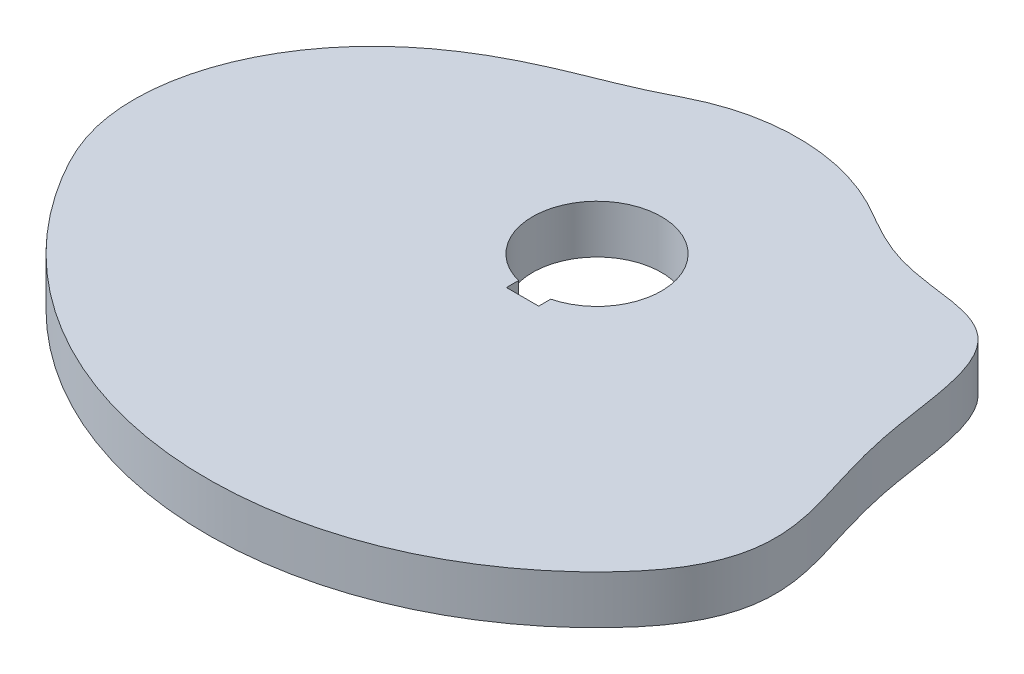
from build123d import *

# Parameters (mm, degrees)
SKETCH1_R                        = 177.8
SKETCH1_R_2                      = 25.4
DISC_CW_INSIDE_SWINGINGARM_DEPTH = 19.05
KEYWAY_0_5000_X_0_3750MM_DEPTH   = 253.167766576
SINGLE_SURFACE_SKETCH_R          = 177.8
SINGLE_SURFACE_DEPTH             = 20.6502


with BuildPart() as part:
    # Sketch1 → Disc_ CW_ Inside_ SwingingArm (new body)
    with BuildSketch(Plane(origin=(0, 0, 0), x_dir=(1, 0, 0), z_dir=(0, 1, 0))):
        with Locations(Location((0, 0, 0), (0, 0, 270))):
            Circle(SKETCH1_R)
        with Locations(Location((0, 0, 0), (0, 0, 270))):
            Circle(SKETCH1_R_2, mode=Mode.SUBTRACT)
    extrude(amount=-DISC_CW_INSIDE_SWINGINGARM_DEPTH)

    # Sketch7 → Keyway_ 0.5000 x 0.3750mm (cut, through all)
    with BuildSketch(Plane(origin=(0, 0, 0), x_dir=(1, 0, 0), z_dir=(0, 1, 0))):
        with BuildLine():
            Line((-6.35, -24.593444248), (-6.35, -29.355944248))
            Line((-6.35, -29.355944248), (6.35, -29.355944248))
            Line((6.35, -29.355944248), (6.35, -24.593444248))
            ThreePointArc((6.35, -24.593444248), (0, 25.4), (-6.35, -24.593444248))
        make_face()
    extrude(amount=-KEYWAY_0_5000_X_0_3750MM_DEPTH, mode=Mode.SUBTRACT)

    # Single Surface Sketch → Single Surface (cut)
    with BuildSketch(Plane(origin=(0, 0, 0), x_dir=(1, 0, 0), z_dir=(0, 1, 0))):
        Circle(SINGLE_SURFACE_SKETCH_R)
        with BuildLine():
            add(Edge.make_bspline(
                [(114.054198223, 24.302791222), (113.900836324, 25.022534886), (113.599117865, 26.37563906), (113.11679871, 28.335120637), (112.620093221, 30.162893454), (112.091035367, 31.920319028), (111.52865963, 33.603254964), (110.932781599, 35.207999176), (110.303920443, 36.73148022), (109.643177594, 38.171445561), (108.9520673, 39.526633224), (108.232302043, 40.796907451), (107.485541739, 41.983338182), (106.713123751, 43.088205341), (105.915798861, 44.11491405), (105.09350463, 45.067816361), (104.245209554, 45.951948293), (103.368857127, 46.772705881), (102.461427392, 47.535497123), (101.519116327, 48.245414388), (100.537613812, 48.90697103), (99.512443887, 49.523936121), (98.439320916, 50.099284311), (97.314474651, 50.635258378), (96.134905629, 51.133524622), (94.898546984, 51.595390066), (93.604325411, 52.022046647), (92.252128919, 52.414810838), (90.842699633, 52.775334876), (89.377475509, 53.105775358), (87.858406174, 53.408914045), (86.287766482, 53.688232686), (84.667988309, 53.947947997), (83.00152781, 54.193014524), (81.290782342, 54.429102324), (79.538068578, 54.662553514), (77.745670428, 54.900317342), (75.915961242, 55.149857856), (74.051598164, 55.419022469), (72.155776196, 55.715855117), (70.232515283, 56.048336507), (68.286936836, 56.424039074), (66.325470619, 56.849698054), (64.355925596, 57.330723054), (62.387366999, 57.870702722), (60.429771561, 58.470979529), (58.493481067, 59.130380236), (56.588528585, 59.845170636), (54.723952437, 60.609260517), (52.907222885, 61.414628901), (51.143880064, 62.25189063), (49.437429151, 63.110901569), (47.789480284, 63.981307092), (46.200076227, 64.852970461), (44.668129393, 65.716257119), (43.191894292, 66.562190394), (41.769409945, 67.382500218), (40.398897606, 68.169649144), (39.079014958, 68.916721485), (37.806636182, 69.619179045), (36.563071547, 70.280549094), (35.328237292, 70.909138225), (34.085336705, 71.514930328), (32.832033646, 72.098901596), (31.568734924, 72.660920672), (30.295818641, 73.200803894), (29.013674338, 73.718390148), (27.722692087, 74.213520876), (26.423265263, 74.686045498), (25.115789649, 75.135820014), (23.800663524, 75.562707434), (22.478287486, 75.966577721), (21.149064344, 76.347307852), (19.813398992, 76.704781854), (18.471698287, 77.038890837), (17.124370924, 77.349533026), (15.771827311, 77.636613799), (14.414479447, 77.900045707), (13.052740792, 78.139748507), (11.687026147, 78.355649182), (10.31775152, 78.547681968), (8.945334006, 78.715788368), (7.570191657, 78.859917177), (6.192743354, 78.980024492), (4.813408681, 79.076073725), (3.432607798, 79.148035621), (2.050761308, 79.195888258), (0.668290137, 79.219617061), (-0.714384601, 79.2192148), (-2.096841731, 79.1946816), (-3.478660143, 79.146024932), (-4.859418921, 79.073259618), (-6.238697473, 78.976407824), (-7.616075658, 78.855499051), (-8.991133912, 78.710570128), (-10.363453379, 78.541665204), (-11.732616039, 78.348835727), (-13.098204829, 78.132140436), (-14.45980378, 77.891645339), (-15.816998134, 77.627423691), (-17.169374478, 77.339555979), (-18.516520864, 77.028129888), (-19.858026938, 76.693240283), (-21.193484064, 76.334989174), (-22.522485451, 75.953485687), (-23.844626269, 75.548846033), (-25.159503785, 75.12119347), (-26.466717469, 74.670658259), (-27.765869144, 74.19737766), (-29.056563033, 73.701495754), (-30.338406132, 73.183163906), (-31.61100741, 72.642538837), (-32.831883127, 72.098547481), (-34.103423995, 71.506506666), (-35.412060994, 70.868626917), (-36.831435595, 70.15730777), (-38.292360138, 69.416331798), (-39.834890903, 68.634709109), (-41.455290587, 67.823304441), (-43.14752035, 66.993186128), (-44.903620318, 66.154522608), (-46.714357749, 65.315880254), (-48.569695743, 64.482871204), (-50.460956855, 63.660407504), (-52.380714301, 62.845340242), (-54.326950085, 62.03648373), (-56.29969533, 61.22912717), (-58.299512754, 60.418917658), (-60.326898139, 59.601270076), (-62.382293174, 58.771607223), (-64.465995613, 57.925339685), (-66.578108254, 57.057908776), (-68.718489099, 56.164806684), (-70.886713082, 55.241599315), (-73.082042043, 54.283946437), (-75.303403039, 53.287621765), (-77.549374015, 52.24853302), (-79.818176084, 51.162742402), (-82.107671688, 50.026487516), (-84.41536794, 48.836202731), (-86.738424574, 47.588540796), (-89.073665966, 46.280394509), (-91.417596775, 44.908918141), (-93.766420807, 43.471548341), (-96.116062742, 41.966024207), (-98.462192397, 40.390406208), (-100.800251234, 38.743093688), (-103.12548081, 37.022840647), (-105.432952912, 35.228769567), (-107.717601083, 33.360383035), (-109.97425328, 31.417572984), (-112.197665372, 29.400627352), (-114.382555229, 27.310234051), (-116.523637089, 25.147482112), (-118.615655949, 22.91385995), (-120.653421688, 20.611250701), (-122.631842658, 18.241924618), (-124.545958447, 15.808528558), (-126.390971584, 13.314072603), (-128.1622779, 10.761913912), (-129.855495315, 8.15573789), (-131.466490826, 5.499536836), (-132.991405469, 2.797586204), (-134.426677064, 0.054418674), (-135.769060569, -2.72520379), (-137.015645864, -5.536319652), (-138.163872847, -8.3737991), (-139.211543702, -11.232376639), (-140.156832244, -14.106684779), (-140.998290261, -16.991288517), (-141.734850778, -19.880720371), (-142.365828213, -22.769515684), (-142.890915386, -25.652247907), (-143.310177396, -28.523563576), (-143.62404233, -31.378216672), (-143.833289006, -34.211102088), (-143.939031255, -37.017287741), (-143.942700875, -39.792045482), (-143.846021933, -42.530878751), (-143.651003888, -45.229552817), (-143.359853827, -47.884104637), (-142.975173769, -50.490914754), (-142.499074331, -53.046705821), (-141.935984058, -55.549865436), (-141.284866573, -58.000597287), (-140.549287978, -60.403325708), (-139.73016426, -62.764720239), (-138.828934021, -65.092649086), (-137.846827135, -67.395741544), (-136.785205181, -69.683082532), (-135.645669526, -71.963847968), (-134.430380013, -74.247062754), (-133.142964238, -76.539171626), (-131.796369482, -78.834364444), (-130.40176322, -81.120773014), (-128.966109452, -83.384218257), (-127.491222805, -85.622293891), (-125.977487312, -87.834280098), (-124.425381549, -90.019513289), (-122.83537362, -92.177325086), (-121.207949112, -94.307058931), (-119.543603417, -96.408065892), (-117.842843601, -98.479706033), (-116.106187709, -100.521348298), (-114.334164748, -102.532370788), (-112.527314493, -104.512160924), (-110.686187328, -106.460115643), (-108.811344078, -108.37564158), (-106.903355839, -110.258155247), (-104.962803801, -112.107083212), (-102.990279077, -113.921862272), (-100.986382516, -115.701939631), (-98.951724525, -117.446773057), (-96.88692488, -119.155831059), (-94.792612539, -120.82859304), (-92.66942545, -122.464549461), (-90.518010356, -124.063201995), (-88.3390226, -125.624063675), (-86.133125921, -127.146659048), (-83.900992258, -128.630524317), (-81.64330154, -130.075207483), (-79.360741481, -131.48026848), (-77.054007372, -132.845279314), (-74.723801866, -134.169824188), (-72.370834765, -135.453499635), (-69.995822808, -136.695914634), (-67.599489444, -137.896690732), (-65.182564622, -139.055462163), (-62.745784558, -140.171875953), (-60.289891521, -141.245592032), (-57.815633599, -142.276283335), (-55.323764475, -143.263635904), (-52.815043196, -144.207348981), (-50.290233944, -145.107135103), (-47.750105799, -145.962720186), (-45.195432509, -146.773843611), (-42.626992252, -147.540258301), (-40.045567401, -148.261730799), (-37.451944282, -148.938041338), (-34.846912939, -149.568983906), (-32.231266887, -150.154366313), (-29.60580288, -150.694010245), (-26.971320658, -151.187751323), (-24.328622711, -151.635439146), (-21.67851403, -152.036937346), (-19.021801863, -152.392123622), (-16.359295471, -152.70088978), (-13.69180588, -152.963141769), (-11.020145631, -153.178799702), (-8.34512854, -153.34779789), (-5.667569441, -153.470084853), (-2.988283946, -153.545623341), (-0.308088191, -153.574390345), (2.372201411, -153.556377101), (5.051768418, -153.491589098), (7.729796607, -153.38004607), (10.405470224, -153.221781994), (13.077974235, -153.016845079), (15.746494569, -152.765297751), (18.410218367, -152.467216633), (21.068334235, -152.122692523), (23.720032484, -151.731830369), (26.364505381, -151.294749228), (29.000947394, -150.811582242), (31.628555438, -150.282476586), (34.246529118, -149.707593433), (36.854070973, -149.087107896), (39.450386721, -148.421208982), (42.034685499, -147.710099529), (44.606180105, -146.95399615), (47.164087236, -146.15312916), (49.707627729, -145.307742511), (52.236026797, -144.418093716), (54.748514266, -143.48445377), (57.244324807, -142.50710707), (59.722698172, -141.486351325), (62.182879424, -140.422497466), (64.624119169, -139.315869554), (67.045673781, -138.166804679), (69.446805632, -136.975652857), (71.826783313, -135.742776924), (74.184881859, -134.468552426), (76.520382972, -133.153367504), (78.832575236, -131.797622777), (81.120754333, -130.401731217), (83.384223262, -128.966118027), (85.62229255, -127.491220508), (87.834280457, -125.977487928), (90.019513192, -124.425381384), (92.177325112, -122.835373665), (94.307058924, -121.207949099), (96.408065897, -119.543603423), (98.47970602, -117.84284359), (100.521348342, -116.106187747), (102.532370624, -114.334164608), (104.512161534, -112.527315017), (106.460113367, -110.686185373), (108.375650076, -108.811351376), (110.255065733, -106.906427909), (112.090514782, -104.980470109), (113.870058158, -103.0399956), (115.584293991, -101.089442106), (117.228285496, -99.129471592), (118.797451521, -97.161058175), (120.28763046, -95.185526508), (121.695141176, -93.204483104), (123.016847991, -91.219743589), (124.250211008, -89.233244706), (125.393322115, -87.246947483), (126.44492244, -85.262734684), (127.404399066, -83.282307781), (128.271759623, -81.307089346), (129.047585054, -79.338137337), (129.732962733, -77.376077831), (130.32940416, -75.421062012), (130.838753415, -73.472751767), (131.263093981, -71.530335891), (131.604662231, -69.592576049), (131.86577551, -67.657878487), (132.048781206, -65.72438467), (132.156030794, -63.790071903), (132.189879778, -61.852854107), (132.152711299, -59.910673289), (132.046978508, -57.961573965), (131.875258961, -56.003755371), (131.640313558, -54.035599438), (131.345142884, -52.055675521), (130.993035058, -50.062725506), (130.587600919, -48.055634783), (130.132794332, -46.033395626), (129.632917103, -43.995069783), (129.092609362, -41.939756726), (128.516826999, -39.866573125), (127.910807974, -37.774647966), (127.280028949, -35.663136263), (126.630152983, -33.531252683), (125.966968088, -31.378324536), (125.296315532, -29.203861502), (124.624006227, -27.007637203), (123.955723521, -24.789775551), (123.296911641, -22.550832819), (122.652650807, -20.291865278), (122.027522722, -18.014472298), (121.425473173, -15.720806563), (120.849681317, -13.413546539), (120.302446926, -11.095831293), (119.785106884, -8.771163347), (119.297990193, -6.443290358), (118.840416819, -4.116079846), (118.410740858, -1.793402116), (118.006433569, 0.520965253), (117.62419802, 2.823401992), (117.260104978, 5.110474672), (116.909739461, 7.37893233), (116.568348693, 9.625673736), (116.230984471, 11.847694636), (115.892635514, 14.042024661), (115.54834753, 16.205662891), (115.193330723, 18.335521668), (114.823054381, 20.428380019), (114.445971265, 22.414306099), (114.182577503, 23.700293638), (114.054198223, 24.302791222)],
                knots=[0, 0, 0, 0, 0.002758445, 0.005196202, 0.007563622, 0.00985746, 0.012074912, 0.014213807, 0.016272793, 0.018251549, 0.020150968, 0.021973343, 0.023722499, 0.025403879, 0.027024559, 0.028593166, 0.030119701, 0.031615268, 0.033091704, 0.034561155, 0.036035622, 0.037526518, 0.039044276, 0.040598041, 0.042195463, 0.0438426, 0.045543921, 0.047302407, 0.049119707, 0.050996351, 0.052931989, 0.054925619, 0.056975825, 0.059080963, 0.061239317, 0.06344919, 0.065708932, 0.068016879, 0.070371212, 0.072769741, 0.075209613, 0.077687, 0.080196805, 0.082732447, 0.085285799, 0.087847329, 0.090406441, 0.09295199, 0.095472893, 0.097958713, 0.100400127, 0.102789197, 0.105119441, 0.107385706, 0.109583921, 0.111710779, 0.113763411, 0.115739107, 0.117635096, 0.119448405, 0.121186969, 0.122914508, 0.124642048, 0.126369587, 0.128097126, 0.129824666, 0.131552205, 0.133279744, 0.135007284, 0.136734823, 0.138462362, 0.140189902, 0.141917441, 0.14364498, 0.14537252, 0.147100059, 0.148827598, 0.150555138, 0.152282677, 0.154010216, 0.155737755, 0.157465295, 0.159192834, 0.160920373, 0.162647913, 0.164375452, 0.166102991, 0.167830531, 0.16955807, 0.171285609, 0.173013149, 0.174740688, 0.176468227, 0.178195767, 0.179923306, 0.181650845, 0.183378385, 0.185105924, 0.186833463, 0.188561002, 0.190288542, 0.192016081, 0.19374362, 0.19547116, 0.197198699, 0.198926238, 0.200653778, 0.202381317, 0.204108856, 0.205836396, 0.207563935, 0.209291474, 0.211019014, 0.212573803, 0.214548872, 0.216475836, 0.218524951, 0.220689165, 0.222957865, 0.225317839, 0.227754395, 0.230252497, 0.232797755, 0.235377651, 0.237982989, 0.240615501, 0.243277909, 0.245973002, 0.248703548, 0.251472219, 0.254281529, 0.257133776, 0.260031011, 0.262975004, 0.265967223, 0.269008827, 0.272100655, 0.275243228, 0.278436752, 0.281681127, 0.284975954, 0.288320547, 0.291713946, 0.295154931, 0.298642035, 0.302173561, 0.305747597, 0.309362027, 0.313014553, 0.316702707, 0.320423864, 0.324175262, 0.327954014, 0.331757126, 0.335581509, 0.339423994, 0.343281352, 0.347150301, 0.351027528, 0.354909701, 0.358793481, 0.362675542, 0.366552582, 0.37042134, 0.374278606, 0.378121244, 0.381946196, 0.385750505, 0.389531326, 0.393285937, 0.39701176, 0.400706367, 0.404367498, 0.407993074, 0.411581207, 0.415130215, 0.418638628, 0.422105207, 0.425528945, 0.428909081, 0.432245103, 0.43553676, 0.438784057, 0.441987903, 0.445151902, 0.448286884, 0.451404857, 0.454518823, 0.457642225, 0.460788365, 0.463969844, 0.467198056, 0.47048278, 0.473823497, 0.477172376, 0.480521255, 0.483870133, 0.487219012, 0.490567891, 0.49391677, 0.497265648, 0.500614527, 0.503963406, 0.507312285, 0.510661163, 0.514010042, 0.517358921, 0.520707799, 0.524056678, 0.527405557, 0.530754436, 0.534103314, 0.537452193, 0.540801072, 0.544149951, 0.547498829, 0.550847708, 0.554196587, 0.557545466, 0.560894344, 0.564243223, 0.567592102, 0.570940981, 0.574289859, 0.577638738, 0.580987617, 0.584336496, 0.587685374, 0.591034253, 0.594383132, 0.597732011, 0.601080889, 0.604429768, 0.607778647, 0.611127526, 0.614476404, 0.617825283, 0.621174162, 0.624523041, 0.627871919, 0.631220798, 0.634569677, 0.637918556, 0.641267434, 0.644616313, 0.647965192, 0.651314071, 0.654662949, 0.658011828, 0.661360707, 0.664709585, 0.668058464, 0.671407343, 0.674756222, 0.6781051, 0.681453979, 0.684802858, 0.688151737, 0.691500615, 0.694849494, 0.698198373, 0.701547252, 0.70489613, 0.708245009, 0.711593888, 0.714942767, 0.718291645, 0.721640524, 0.724989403, 0.728338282, 0.73168716, 0.735036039, 0.738384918, 0.741733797, 0.745082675, 0.748431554, 0.751780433, 0.755129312, 0.75847819, 0.761827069, 0.765175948, 0.768524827, 0.771873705, 0.775222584, 0.778571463, 0.781920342, 0.78526922, 0.788618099, 0.791966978, 0.795315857, 0.798664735, 0.802013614, 0.805362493, 0.808711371, 0.81206025, 0.815409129, 0.818758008, 0.822106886, 0.825455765, 0.828788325, 0.832079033, 0.835324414, 0.838521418, 0.841667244, 0.844759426, 0.847795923, 0.85077521, 0.853696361, 0.856559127, 0.859364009, 0.862112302, 0.864806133, 0.86744847, 0.870043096, 0.872594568, 0.87510813, 0.877589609, 0.880045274, 0.882481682, 0.884905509, 0.887323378, 0.889741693, 0.89216649, 0.89460331, 0.897057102, 0.899532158, 0.90203208, 0.904559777, 0.907117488, 0.909706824, 0.912328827, 0.914984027, 0.917672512, 0.920393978, 0.923147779, 0.925932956, 0.928748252, 0.931592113, 0.934462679, 0.937357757, 0.940274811, 0.943210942, 0.946162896, 0.949127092, 0.952099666, 0.955076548, 0.958053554, 0.961026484, 0.963991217, 0.966943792, 0.96988047, 0.972797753, 0.975692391, 0.978561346, 0.981401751, 0.984210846, 0.986985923, 0.989724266, 0.992423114, 0.995079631, 0.997690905, 1, 1, 1, 1], degree=3))
        make_face(mode=Mode.SUBTRACT)
    extrude(amount=-SINGLE_SURFACE_DEPTH, mode=Mode.SUBTRACT)


solid = part.part
